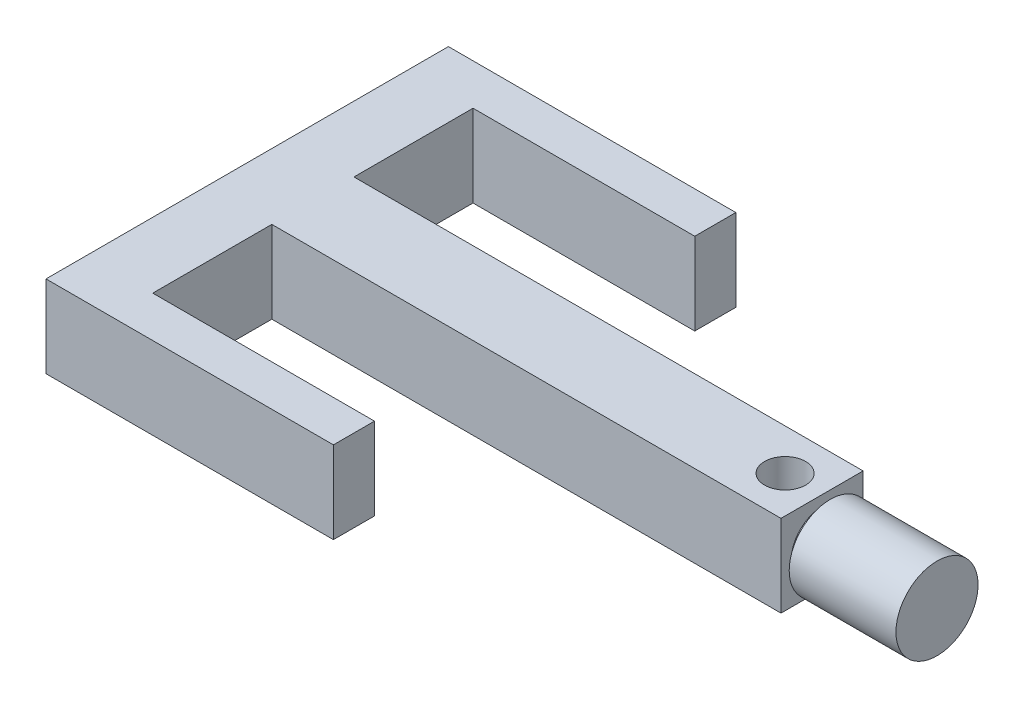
ISO-10303-21;
HEADER;
FILE_DESCRIPTION(('STEP AP214'),'2;1');
FILE_NAME('part.step','',(''),(''),'','','');
FILE_SCHEMA(('AUTOMOTIVE_DESIGN { 1 0 10303 214 1 1 1 1 }'));
ENDSEC;
DATA;
#1=APPLICATION_CONTEXT('core data for automotive mechanical design processes');
#2=APPLICATION_PROTOCOL_DEFINITION('international standard','automotive_design',2000,#1);
#3=PRODUCT_CONTEXT('',#1,'mechanical');
#4=PRODUCT('Part','Part','',(#3));
#5=PRODUCT_RELATED_PRODUCT_CATEGORY('part','',(#4));
#6=PRODUCT_DEFINITION_FORMATION('','',#4);
#7=PRODUCT_DEFINITION_CONTEXT('part definition',#1,'design');
#8=PRODUCT_DEFINITION('design','',#6,#7);
#9=PRODUCT_DEFINITION_SHAPE('','',#8);
#10=(LENGTH_UNIT() NAMED_UNIT(*) SI_UNIT(.MILLI.,.METRE.));
#11=(NAMED_UNIT(*) PLANE_ANGLE_UNIT() SI_UNIT($,.RADIAN.));
#12=(NAMED_UNIT(*) SI_UNIT($,.STERADIAN.) SOLID_ANGLE_UNIT());
#13=UNCERTAINTY_MEASURE_WITH_UNIT(LENGTH_MEASURE(1.E-05),#10,'distance_accuracy_value','');
#14=(GEOMETRIC_REPRESENTATION_CONTEXT(3) GLOBAL_UNCERTAINTY_ASSIGNED_CONTEXT((#13)) GLOBAL_UNIT_ASSIGNED_CONTEXT((#10,
#11,#12)) REPRESENTATION_CONTEXT('',''));
#15=CARTESIAN_POINT('',(0.,0.,0.));
#16=DIRECTION('',(0.,0.,1.));
#17=DIRECTION('',(1.,0.,0.));
#18=AXIS2_PLACEMENT_3D('',#15,#16,#17);
#19=CARTESIAN_POINT('',(70.,20.,0.));
#20=DIRECTION('',(0.,0.,-1.));
#21=DIRECTION('',(-1.,0.,0.));
#22=AXIS2_PLACEMENT_3D('',#19,#20,#21);
#23=PLANE('',#22);
#24=DIRECTION('',(1.,0.,0.));
#25=VECTOR('',#24,1.);
#26=CARTESIAN_POINT('',(70.,0.,0.));
#27=LINE('',#26,#25);
#28=CARTESIAN_POINT('',(0.,0.,0.));
#29=VERTEX_POINT('',#28);
#30=CARTESIAN_POINT('',(70.,0.,0.));
#31=VERTEX_POINT('',#30);
#32=EDGE_CURVE('E167',#29,#31,#27,.T.);
#33=ORIENTED_EDGE('',*,*,#32,.T.);
#34=DIRECTION('',(0.,-1.,0.));
#35=VECTOR('',#34,1.);
#36=CARTESIAN_POINT('',(70.,20.,0.));
#37=LINE('',#36,#35);
#38=CARTESIAN_POINT('',(70.,20.,0.));
#39=VERTEX_POINT('',#38);
#40=EDGE_CURVE('E49',#39,#31,#37,.T.);
#41=ORIENTED_EDGE('',*,*,#40,.F.);
#42=DIRECTION('',(1.,0.,0.));
#43=VECTOR('',#42,1.);
#44=CARTESIAN_POINT('',(70.,20.,0.));
#45=LINE('',#44,#43);
#46=CARTESIAN_POINT('',(0.,20.,0.));
#47=VERTEX_POINT('',#46);
#48=EDGE_CURVE('E202',#47,#39,#45,.T.);
#49=ORIENTED_EDGE('',*,*,#48,.F.);
#50=DIRECTION('',(0.,-1.,0.));
#51=VECTOR('',#50,1.);
#52=CARTESIAN_POINT('',(0.,20.,0.));
#53=LINE('',#52,#51);
#54=EDGE_CURVE('E163',#47,#29,#53,.T.);
#55=ORIENTED_EDGE('',*,*,#54,.T.);
#56=EDGE_LOOP('',(#33,#41,#49,#55));
#57=FACE_BOUND('',#56,.T.);
#58=ADVANCED_FACE('F39',(#57),#23,.F.);
#59=CARTESIAN_POINT('',(70.,20.,-10.));
#60=DIRECTION('',(-1.,0.,0.));
#61=DIRECTION('',(0.,0.,1.));
#62=AXIS2_PLACEMENT_3D('',#59,#60,#61);
#63=PLANE('',#62);
#64=DIRECTION('',(0.,0.,-1.));
#65=VECTOR('',#64,1.);
#66=CARTESIAN_POINT('',(70.,0.,-10.));
#67=LINE('',#66,#65);
#68=CARTESIAN_POINT('',(70.,0.,-10.));
#69=VERTEX_POINT('',#68);
#70=EDGE_CURVE('E171',#31,#69,#67,.T.);
#71=ORIENTED_EDGE('',*,*,#70,.T.);
#72=DIRECTION('',(0.,-1.,0.));
#73=VECTOR('',#72,1.);
#74=CARTESIAN_POINT('',(70.,20.,-10.));
#75=LINE('',#74,#73);
#76=CARTESIAN_POINT('',(70.,20.,-10.));
#77=VERTEX_POINT('',#76);
#78=EDGE_CURVE('E233',#77,#69,#75,.T.);
#79=ORIENTED_EDGE('',*,*,#78,.F.);
#80=DIRECTION('',(0.,0.,-1.));
#81=VECTOR('',#80,1.);
#82=CARTESIAN_POINT('',(70.,20.,-10.));
#83=LINE('',#82,#81);
#84=EDGE_CURVE('E114',#39,#77,#83,.T.);
#85=ORIENTED_EDGE('',*,*,#84,.F.);
#86=ORIENTED_EDGE('',*,*,#40,.T.);
#87=EDGE_LOOP('',(#71,#79,#85,#86));
#88=FACE_BOUND('',#87,.T.);
#89=ADVANCED_FACE('F238',(#88),#63,.F.);
#90=CARTESIAN_POINT('',(16.,20.,-10.));
#91=DIRECTION('',(0.,0.,1.));
#92=DIRECTION('',(1.,0.,0.));
#93=AXIS2_PLACEMENT_3D('',#90,#91,#92);
#94=PLANE('',#93);
#95=DIRECTION('',(-1.,0.,0.));
#96=VECTOR('',#95,1.);
#97=CARTESIAN_POINT('',(16.,0.,-10.));
#98=LINE('',#97,#96);
#99=CARTESIAN_POINT('',(16.,0.,-10.));
#100=VERTEX_POINT('',#99);
#101=EDGE_CURVE('E175',#69,#100,#98,.T.);
#102=ORIENTED_EDGE('',*,*,#101,.T.);
#103=DIRECTION('',(0.,-1.,0.));
#104=VECTOR('',#103,1.);
#105=CARTESIAN_POINT('',(16.,20.,-10.));
#106=LINE('',#105,#104);
#107=CARTESIAN_POINT('',(16.,20.,-10.));
#108=VERTEX_POINT('',#107);
#109=EDGE_CURVE('E229',#108,#100,#106,.T.);
#110=ORIENTED_EDGE('',*,*,#109,.F.);
#111=DIRECTION('',(-1.,0.,0.));
#112=VECTOR('',#111,1.);
#113=CARTESIAN_POINT('',(16.,20.,-10.));
#114=LINE('',#113,#112);
#115=EDGE_CURVE('E259',#77,#108,#114,.T.);
#116=ORIENTED_EDGE('',*,*,#115,.F.);
#117=ORIENTED_EDGE('',*,*,#78,.T.);
#118=EDGE_LOOP('',(#102,#110,#116,#117));
#119=FACE_BOUND('',#118,.T.);
#120=ADVANCED_FACE('F249',(#119),#94,.F.);
#121=CARTESIAN_POINT('',(16.,20.,-39.));
#122=DIRECTION('',(-1.,0.,0.));
#123=DIRECTION('',(0.,0.,1.));
#124=AXIS2_PLACEMENT_3D('',#121,#122,#123);
#125=PLANE('',#124);
#126=DIRECTION('',(0.,0.,-1.));
#127=VECTOR('',#126,1.);
#128=CARTESIAN_POINT('',(16.,0.,-39.));
#129=LINE('',#128,#127);
#130=CARTESIAN_POINT('',(16.,0.,-39.));
#131=VERTEX_POINT('',#130);
#132=EDGE_CURVE('E178',#100,#131,#129,.T.);
#133=ORIENTED_EDGE('',*,*,#132,.T.);
#134=DIRECTION('',(0.,-1.,0.));
#135=VECTOR('',#134,1.);
#136=CARTESIAN_POINT('',(16.,20.,-39.));
#137=LINE('',#136,#135);
#138=CARTESIAN_POINT('',(16.,20.,-39.));
#139=VERTEX_POINT('',#138);
#140=EDGE_CURVE('E225',#139,#131,#137,.T.);
#141=ORIENTED_EDGE('',*,*,#140,.F.);
#142=DIRECTION('',(0.,0.,-1.));
#143=VECTOR('',#142,1.);
#144=CARTESIAN_POINT('',(16.,20.,-39.));
#145=LINE('',#144,#143);
#146=EDGE_CURVE('E255',#108,#139,#145,.T.);
#147=ORIENTED_EDGE('',*,*,#146,.F.);
#148=ORIENTED_EDGE('',*,*,#109,.T.);
#149=EDGE_LOOP('',(#133,#141,#147,#148));
#150=FACE_BOUND('',#149,.T.);
#151=ADVANCED_FACE('F253',(#150),#125,.F.);
#152=CARTESIAN_POINT('',(140.,20.,-39.));
#153=DIRECTION('',(0.,0.,-1.));
#154=DIRECTION('',(-1.,0.,0.));
#155=AXIS2_PLACEMENT_3D('',#152,#153,#154);
#156=PLANE('',#155);
#157=DIRECTION('',(1.,0.,0.));
#158=VECTOR('',#157,1.);
#159=CARTESIAN_POINT('',(140.,0.,-39.));
#160=LINE('',#159,#158);
#161=CARTESIAN_POINT('',(140.,0.,-39.));
#162=VERTEX_POINT('',#161);
#163=EDGE_CURVE('E181',#131,#162,#160,.T.);
#164=ORIENTED_EDGE('',*,*,#163,.T.);
#165=DIRECTION('',(0.,-1.,0.));
#166=VECTOR('',#165,1.);
#167=CARTESIAN_POINT('',(140.,20.,-39.));
#168=LINE('',#167,#166);
#169=CARTESIAN_POINT('',(140.,20.,-39.));
#170=VERTEX_POINT('',#169);
#171=EDGE_CURVE('E221',#170,#162,#168,.T.);
#172=ORIENTED_EDGE('',*,*,#171,.F.);
#173=DIRECTION('',(1.,0.,0.));
#174=VECTOR('',#173,1.);
#175=CARTESIAN_POINT('',(140.,20.,-39.));
#176=LINE('',#175,#174);
#177=EDGE_CURVE('E258',#139,#170,#176,.T.);
#178=ORIENTED_EDGE('',*,*,#177,.F.);
#179=ORIENTED_EDGE('',*,*,#140,.T.);
#180=EDGE_LOOP('',(#164,#172,#178,#179));
#181=FACE_BOUND('',#180,.T.);
#182=ADVANCED_FACE('F296',(#181),#156,.F.);
#183=CARTESIAN_POINT('',(140.,20.,-59.));
#184=DIRECTION('',(-1.,0.,0.));
#185=DIRECTION('',(0.,0.,1.));
#186=AXIS2_PLACEMENT_3D('',#183,#184,#185);
#187=PLANE('',#186);
#188=CARTESIAN_POINT('',(140.,10.,-49.));
#189=DIRECTION('',(1.,0.,0.));
#190=DIRECTION('',(0.,0.,-1.));
#191=AXIS2_PLACEMENT_3D('',#188,#189,#190);
#192=CIRCLE('',#191,7.5);
#193=CARTESIAN_POINT('',(140.,10.,-56.5));
#194=VERTEX_POINT('',#193);
#195=EDGE_CURVE('E11',#194,#194,#192,.T.);
#196=ORIENTED_EDGE('',*,*,#195,.F.);
#197=EDGE_LOOP('',(#196));
#198=FACE_BOUND('',#197,.T.);
#199=DIRECTION('',(0.,0.,-1.));
#200=VECTOR('',#199,1.);
#201=CARTESIAN_POINT('',(140.,0.,-59.));
#202=LINE('',#201,#200);
#203=CARTESIAN_POINT('',(140.,0.,-59.));
#204=VERTEX_POINT('',#203);
#205=EDGE_CURVE('E184',#162,#204,#202,.T.);
#206=ORIENTED_EDGE('',*,*,#205,.T.);
#207=DIRECTION('',(0.,-1.,0.));
#208=VECTOR('',#207,1.);
#209=CARTESIAN_POINT('',(140.,20.,-59.));
#210=LINE('',#209,#208);
#211=CARTESIAN_POINT('',(140.,20.,-59.));
#212=VERTEX_POINT('',#211);
#213=EDGE_CURVE('E217',#212,#204,#210,.T.);
#214=ORIENTED_EDGE('',*,*,#213,.F.);
#215=DIRECTION('',(0.,0.,-1.));
#216=VECTOR('',#215,1.);
#217=CARTESIAN_POINT('',(140.,20.,-59.));
#218=LINE('',#217,#216);
#219=EDGE_CURVE('E263',#170,#212,#218,.T.);
#220=ORIENTED_EDGE('',*,*,#219,.F.);
#221=ORIENTED_EDGE('',*,*,#171,.T.);
#222=EDGE_LOOP('',(#206,#214,#220,#221));
#223=FACE_BOUND('',#222,.T.);
#224=ADVANCED_FACE('F293',(#198,#223),#187,.F.);
#225=CARTESIAN_POINT('',(16.,20.,-59.));
#226=DIRECTION('',(0.,0.,1.));
#227=DIRECTION('',(1.,0.,0.));
#228=AXIS2_PLACEMENT_3D('',#225,#226,#227);
#229=PLANE('',#228);
#230=DIRECTION('',(-1.,0.,0.));
#231=VECTOR('',#230,1.);
#232=CARTESIAN_POINT('',(16.,0.,-59.));
#233=LINE('',#232,#231);
#234=CARTESIAN_POINT('',(16.,0.,-59.));
#235=VERTEX_POINT('',#234);
#236=EDGE_CURVE('E187',#204,#235,#233,.T.);
#237=ORIENTED_EDGE('',*,*,#236,.T.);
#238=DIRECTION('',(0.,-1.,0.));
#239=VECTOR('',#238,1.);
#240=CARTESIAN_POINT('',(16.,20.,-59.));
#241=LINE('',#240,#239);
#242=CARTESIAN_POINT('',(16.,20.,-59.));
#243=VERTEX_POINT('',#242);
#244=EDGE_CURVE('E213',#243,#235,#241,.T.);
#245=ORIENTED_EDGE('',*,*,#244,.F.);
#246=DIRECTION('',(-1.,0.,0.));
#247=VECTOR('',#246,1.);
#248=CARTESIAN_POINT('',(16.,20.,-59.));
#249=LINE('',#248,#247);
#250=EDGE_CURVE('E270',#212,#243,#249,.T.);
#251=ORIENTED_EDGE('',*,*,#250,.F.);
#252=ORIENTED_EDGE('',*,*,#213,.T.);
#253=EDGE_LOOP('',(#237,#245,#251,#252));
#254=FACE_BOUND('',#253,.T.);
#255=ADVANCED_FACE('F289',(#254),#229,.F.);
#256=CARTESIAN_POINT('',(16.,20.,-88.));
#257=DIRECTION('',(-1.,0.,0.));
#258=DIRECTION('',(0.,0.,1.));
#259=AXIS2_PLACEMENT_3D('',#256,#257,#258);
#260=PLANE('',#259);
#261=DIRECTION('',(0.,0.,-1.));
#262=VECTOR('',#261,1.);
#263=CARTESIAN_POINT('',(16.,0.,-88.));
#264=LINE('',#263,#262);
#265=CARTESIAN_POINT('',(16.,0.,-88.));
#266=VERTEX_POINT('',#265);
#267=EDGE_CURVE('E190',#235,#266,#264,.T.);
#268=ORIENTED_EDGE('',*,*,#267,.T.);
#269=DIRECTION('',(0.,-1.,0.));
#270=VECTOR('',#269,1.);
#271=CARTESIAN_POINT('',(16.,20.,-88.));
#272=LINE('',#271,#270);
#273=CARTESIAN_POINT('',(16.,20.,-88.));
#274=VERTEX_POINT('',#273);
#275=EDGE_CURVE('E209',#274,#266,#272,.T.);
#276=ORIENTED_EDGE('',*,*,#275,.F.);
#277=DIRECTION('',(0.,0.,-1.));
#278=VECTOR('',#277,1.);
#279=CARTESIAN_POINT('',(16.,20.,-88.));
#280=LINE('',#279,#278);
#281=EDGE_CURVE('E273',#243,#274,#280,.T.);
#282=ORIENTED_EDGE('',*,*,#281,.F.);
#283=ORIENTED_EDGE('',*,*,#244,.T.);
#284=EDGE_LOOP('',(#268,#276,#282,#283));
#285=FACE_BOUND('',#284,.T.);
#286=ADVANCED_FACE('F281',(#285),#260,.F.);
#287=CARTESIAN_POINT('',(70.,20.,-88.0000000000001));
#288=DIRECTION('',(0.,0.,-1.));
#289=DIRECTION('',(-1.,0.,0.));
#290=AXIS2_PLACEMENT_3D('',#287,#288,#289);
#291=PLANE('',#290);
#292=DIRECTION('',(1.,0.,0.));
#293=VECTOR('',#292,1.);
#294=CARTESIAN_POINT('',(70.,0.,-88.0000000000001));
#295=LINE('',#294,#293);
#296=CARTESIAN_POINT('',(70.,0.,-88.0000000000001));
#297=VERTEX_POINT('',#296);
#298=EDGE_CURVE('E193',#266,#297,#295,.T.);
#299=ORIENTED_EDGE('',*,*,#298,.T.);
#300=DIRECTION('',(0.,-1.,0.));
#301=VECTOR('',#300,1.);
#302=CARTESIAN_POINT('',(70.,20.,-88.0000000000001));
#303=LINE('',#302,#301);
#304=CARTESIAN_POINT('',(70.,20.,-88.0000000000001));
#305=VERTEX_POINT('',#304);
#306=EDGE_CURVE('E156',#305,#297,#303,.T.);
#307=ORIENTED_EDGE('',*,*,#306,.F.);
#308=DIRECTION('',(1.,0.,0.));
#309=VECTOR('',#308,1.);
#310=CARTESIAN_POINT('',(70.,20.,-88.0000000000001));
#311=LINE('',#310,#309);
#312=EDGE_CURVE('E145',#274,#305,#311,.T.);
#313=ORIENTED_EDGE('',*,*,#312,.F.);
#314=ORIENTED_EDGE('',*,*,#275,.T.);
#315=EDGE_LOOP('',(#299,#307,#313,#314));
#316=FACE_BOUND('',#315,.T.);
#317=ADVANCED_FACE('F285',(#316),#291,.F.);
#318=CARTESIAN_POINT('',(70.,20.,-98.));
#319=DIRECTION('',(-1.,0.,0.));
#320=DIRECTION('',(0.,0.,1.));
#321=AXIS2_PLACEMENT_3D('',#318,#319,#320);
#322=PLANE('',#321);
#323=DIRECTION('',(0.,0.,-1.));
#324=VECTOR('',#323,1.);
#325=CARTESIAN_POINT('',(70.,0.,-98.));
#326=LINE('',#325,#324);
#327=CARTESIAN_POINT('',(70.,0.,-98.));
#328=VERTEX_POINT('',#327);
#329=EDGE_CURVE('E154',#297,#328,#326,.T.);
#330=ORIENTED_EDGE('',*,*,#329,.T.);
#331=DIRECTION('',(0.,-1.,0.));
#332=VECTOR('',#331,1.);
#333=CARTESIAN_POINT('',(70.,20.,-98.));
#334=LINE('',#333,#332);
#335=CARTESIAN_POINT('',(70.,20.,-98.));
#336=VERTEX_POINT('',#335);
#337=EDGE_CURVE('E151',#336,#328,#334,.T.);
#338=ORIENTED_EDGE('',*,*,#337,.F.);
#339=DIRECTION('',(0.,0.,-1.));
#340=VECTOR('',#339,1.);
#341=CARTESIAN_POINT('',(70.,20.,-98.));
#342=LINE('',#341,#340);
#343=EDGE_CURVE('E139',#305,#336,#342,.T.);
#344=ORIENTED_EDGE('',*,*,#343,.F.);
#345=ORIENTED_EDGE('',*,*,#306,.T.);
#346=EDGE_LOOP('',(#330,#338,#344,#345));
#347=FACE_BOUND('',#346,.T.);
#348=ADVANCED_FACE('F152',(#347),#322,.F.);
#349=CARTESIAN_POINT('',(0.,20.,-98.));
#350=DIRECTION('',(0.,0.,1.));
#351=DIRECTION('',(1.,0.,0.));
#352=AXIS2_PLACEMENT_3D('',#349,#350,#351);
#353=PLANE('',#352);
#354=DIRECTION('',(-1.,0.,0.));
#355=VECTOR('',#354,1.);
#356=CARTESIAN_POINT('',(0.,0.,-98.));
#357=LINE('',#356,#355);
#358=CARTESIAN_POINT('',(0.,0.,-98.));
#359=VERTEX_POINT('',#358);
#360=EDGE_CURVE('E99',#328,#359,#357,.T.);
#361=ORIENTED_EDGE('',*,*,#360,.T.);
#362=DIRECTION('',(0.,-1.,0.));
#363=VECTOR('',#362,1.);
#364=CARTESIAN_POINT('',(0.,20.,-98.));
#365=LINE('',#364,#363);
#366=CARTESIAN_POINT('',(0.,20.,-98.));
#367=VERTEX_POINT('',#366);
#368=EDGE_CURVE('E157',#367,#359,#365,.T.);
#369=ORIENTED_EDGE('',*,*,#368,.F.);
#370=DIRECTION('',(-1.,0.,0.));
#371=VECTOR('',#370,1.);
#372=CARTESIAN_POINT('',(0.,20.,-98.));
#373=LINE('',#372,#371);
#374=EDGE_CURVE('E143',#336,#367,#373,.T.);
#375=ORIENTED_EDGE('',*,*,#374,.F.);
#376=ORIENTED_EDGE('',*,*,#337,.T.);
#377=EDGE_LOOP('',(#361,#369,#375,#376));
#378=FACE_BOUND('',#377,.T.);
#379=ADVANCED_FACE('F159',(#378),#353,.F.);
#380=CARTESIAN_POINT('',(0.,20.,0.));
#381=DIRECTION('',(1.,0.,0.));
#382=DIRECTION('',(0.,0.,-1.));
#383=AXIS2_PLACEMENT_3D('',#380,#381,#382);
#384=PLANE('',#383);
#385=DIRECTION('',(0.,0.,1.));
#386=VECTOR('',#385,1.);
#387=CARTESIAN_POINT('',(0.,0.,0.));
#388=LINE('',#387,#386);
#389=EDGE_CURVE('E105',#359,#29,#388,.T.);
#390=ORIENTED_EDGE('',*,*,#389,.T.);
#391=ORIENTED_EDGE('',*,*,#54,.F.);
#392=DIRECTION('',(0.,0.,1.));
#393=VECTOR('',#392,1.);
#394=CARTESIAN_POINT('',(0.,20.,0.));
#395=LINE('',#394,#393);
#396=EDGE_CURVE('E58',#367,#47,#395,.T.);
#397=ORIENTED_EDGE('',*,*,#396,.F.);
#398=ORIENTED_EDGE('',*,*,#368,.T.);
#399=EDGE_LOOP('',(#390,#391,#397,#398));
#400=FACE_BOUND('',#399,.T.);
#401=ADVANCED_FACE('F366',(#400),#384,.F.);
#402=CARTESIAN_POINT('',(0.,20.,0.));
#403=DIRECTION('',(0.,-1.,0.));
#404=DIRECTION('',(0.,0.,-1.));
#405=AXIS2_PLACEMENT_3D('',#402,#403,#404);
#406=PLANE('',#405);
#407=CARTESIAN_POINT('',(131.,20.,-49.));
#408=DIRECTION('',(0.,1.,0.));
#409=DIRECTION('',(0.,0.,1.));
#410=AXIS2_PLACEMENT_3D('',#407,#408,#409);
#411=CIRCLE('',#410,4.99999999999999);
#412=CARTESIAN_POINT('',(131.,20.,-44.));
#413=VERTEX_POINT('',#412);
#414=EDGE_CURVE('E456',#413,#413,#411,.T.);
#415=ORIENTED_EDGE('',*,*,#414,.F.);
#416=EDGE_LOOP('',(#415));
#417=FACE_BOUND('',#416,.T.);
#418=ORIENTED_EDGE('',*,*,#48,.T.);
#419=ORIENTED_EDGE('',*,*,#84,.T.);
#420=ORIENTED_EDGE('',*,*,#115,.T.);
#421=ORIENTED_EDGE('',*,*,#146,.T.);
#422=ORIENTED_EDGE('',*,*,#177,.T.);
#423=ORIENTED_EDGE('',*,*,#219,.T.);
#424=ORIENTED_EDGE('',*,*,#250,.T.);
#425=ORIENTED_EDGE('',*,*,#281,.T.);
#426=ORIENTED_EDGE('',*,*,#312,.T.);
#427=ORIENTED_EDGE('',*,*,#343,.T.);
#428=ORIENTED_EDGE('',*,*,#374,.T.);
#429=ORIENTED_EDGE('',*,*,#396,.T.);
#430=EDGE_LOOP('',(#418,#419,#420,#421,#422,#423,#424,#425,#426,#427,#428,#429));
#431=FACE_BOUND('',#430,.T.);
#432=ADVANCED_FACE('F141',(#417,#431),#406,.F.);
#433=CARTESIAN_POINT('',(0.,0.,0.));
#434=DIRECTION('',(0.,-1.,0.));
#435=DIRECTION('',(0.,0.,-1.));
#436=AXIS2_PLACEMENT_3D('',#433,#434,#435);
#437=PLANE('',#436);
#438=CARTESIAN_POINT('',(131.,0.,-49.));
#439=DIRECTION('',(0.,-1.,0.));
#440=DIRECTION('',(0.,0.,-1.));
#441=AXIS2_PLACEMENT_3D('',#438,#439,#440);
#442=CIRCLE('',#441,4.99999999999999);
#443=CARTESIAN_POINT('',(131.,0.,-54.));
#444=VERTEX_POINT('',#443);
#445=EDGE_CURVE('E42',#444,#444,#442,.T.);
#446=ORIENTED_EDGE('',*,*,#445,.F.);
#447=EDGE_LOOP('',(#446));
#448=FACE_BOUND('',#447,.T.);
#449=ORIENTED_EDGE('',*,*,#32,.F.);
#450=ORIENTED_EDGE('',*,*,#389,.F.);
#451=ORIENTED_EDGE('',*,*,#360,.F.);
#452=ORIENTED_EDGE('',*,*,#329,.F.);
#453=ORIENTED_EDGE('',*,*,#298,.F.);
#454=ORIENTED_EDGE('',*,*,#267,.F.);
#455=ORIENTED_EDGE('',*,*,#236,.F.);
#456=ORIENTED_EDGE('',*,*,#205,.F.);
#457=ORIENTED_EDGE('',*,*,#163,.F.);
#458=ORIENTED_EDGE('',*,*,#132,.F.);
#459=ORIENTED_EDGE('',*,*,#101,.F.);
#460=ORIENTED_EDGE('',*,*,#70,.F.);
#461=EDGE_LOOP('',(#449,#450,#451,#452,#453,#454,#455,#456,#457,#458,#459,#460));
#462=FACE_BOUND('',#461,.T.);
#463=ADVANCED_FACE('F243',(#448,#462),#437,.T.);
#464=CARTESIAN_POINT('',(142.,10.,-49.));
#465=DIRECTION('',(-1.,0.,0.));
#466=DIRECTION('',(0.,0.,1.));
#467=AXIS2_PLACEMENT_3D('',#464,#465,#466);
#468=CYLINDRICAL_SURFACE('',#467,7.5);
#469=CARTESIAN_POINT('',(142.,10.,-49.));
#470=DIRECTION('',(1.,0.,0.));
#471=DIRECTION('',(0.,0.,-1.));
#472=AXIS2_PLACEMENT_3D('',#469,#470,#471);
#473=CIRCLE('',#472,7.5);
#474=CARTESIAN_POINT('',(142.,10.,-56.5));
#475=VERTEX_POINT('',#474);
#476=EDGE_CURVE('E172',#475,#475,#473,.T.);
#477=ORIENTED_EDGE('',*,*,#476,.F.);
#478=EDGE_LOOP('',(#477));
#479=FACE_BOUND('',#478,.T.);
#480=ORIENTED_EDGE('',*,*,#195,.T.);
#481=EDGE_LOOP('',(#480));
#482=FACE_BOUND('',#481,.T.);
#483=ADVANCED_FACE('F386',(#479,#482),#468,.T.);
#484=CARTESIAN_POINT('',(168.,10.,-49.));
#485=DIRECTION('',(-1.,0.,0.));
#486=DIRECTION('',(0.,0.,1.));
#487=AXIS2_PLACEMENT_3D('',#484,#485,#486);
#488=CYLINDRICAL_SURFACE('',#487,10.);
#489=CARTESIAN_POINT('',(168.,10.,-49.));
#490=DIRECTION('',(1.,0.,0.));
#491=DIRECTION('',(0.,0.,-1.));
#492=AXIS2_PLACEMENT_3D('',#489,#490,#491);
#493=CIRCLE('',#492,10.);
#494=CARTESIAN_POINT('',(168.,10.,-39.));
#495=VERTEX_POINT('',#494);
#496=EDGE_CURVE('E462',#495,#495,#493,.T.);
#497=CARTESIAN_POINT('',(142.,10.,-49.));
#498=DIRECTION('',(1.,0.,0.));
#499=DIRECTION('',(0.,0.,-1.));
#500=AXIS2_PLACEMENT_3D('',#497,#498,#499);
#501=CIRCLE('',#500,10.);
#502=CARTESIAN_POINT('',(142.,10.,-39.));
#503=VERTEX_POINT('',#502);
#504=EDGE_CURVE('E460',#503,#503,#501,.T.);
#505=CARTESIAN_POINT('',(168.,10.,-39.));
#506=CARTESIAN_POINT('',(167.729166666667,10.,-39.));
#507=CARTESIAN_POINT('',(167.458333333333,10.,-39.));
#508=CARTESIAN_POINT('',(166.916666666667,10.,-39.));
#509=CARTESIAN_POINT('',(166.645833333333,10.,-39.));
#510=CARTESIAN_POINT('',(166.104166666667,10.,-39.));
#511=CARTESIAN_POINT('',(165.833333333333,10.,-39.));
#512=CARTESIAN_POINT('',(165.291666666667,10.,-39.));
#513=CARTESIAN_POINT('',(165.020833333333,10.,-39.));
#514=CARTESIAN_POINT('',(164.479166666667,10.,-39.));
#515=CARTESIAN_POINT('',(164.208333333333,10.,-39.));
#516=CARTESIAN_POINT('',(163.666666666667,10.,-39.));
#517=CARTESIAN_POINT('',(163.395833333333,10.,-39.));
#518=CARTESIAN_POINT('',(162.854166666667,10.,-39.));
#519=CARTESIAN_POINT('',(162.583333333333,10.,-39.));
#520=CARTESIAN_POINT('',(162.041666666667,10.,-39.));
#521=CARTESIAN_POINT('',(161.770833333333,10.,-39.));
#522=CARTESIAN_POINT('',(161.229166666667,10.,-39.));
#523=CARTESIAN_POINT('',(160.958333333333,10.,-39.));
#524=CARTESIAN_POINT('',(160.416666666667,10.,-39.));
#525=CARTESIAN_POINT('',(160.145833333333,10.,-39.));
#526=CARTESIAN_POINT('',(159.604166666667,10.,-39.));
#527=CARTESIAN_POINT('',(159.333333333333,10.,-39.));
#528=CARTESIAN_POINT('',(158.791666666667,10.,-39.));
#529=CARTESIAN_POINT('',(158.520833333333,10.,-39.));
#530=CARTESIAN_POINT('',(157.979166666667,10.,-39.));
#531=CARTESIAN_POINT('',(157.708333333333,10.,-39.));
#532=CARTESIAN_POINT('',(157.166666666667,10.,-39.));
#533=CARTESIAN_POINT('',(156.895833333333,10.,-39.));
#534=CARTESIAN_POINT('',(156.354166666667,10.,-39.));
#535=CARTESIAN_POINT('',(156.083333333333,10.,-39.));
#536=CARTESIAN_POINT('',(155.541666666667,10.,-39.));
#537=CARTESIAN_POINT('',(155.270833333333,10.,-39.));
#538=CARTESIAN_POINT('',(154.729166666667,10.,-39.));
#539=CARTESIAN_POINT('',(154.458333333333,10.,-39.));
#540=CARTESIAN_POINT('',(153.916666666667,10.,-39.));
#541=CARTESIAN_POINT('',(153.645833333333,10.,-39.));
#542=CARTESIAN_POINT('',(153.104166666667,10.,-39.));
#543=CARTESIAN_POINT('',(152.833333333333,10.,-39.));
#544=CARTESIAN_POINT('',(152.291666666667,10.,-39.));
#545=CARTESIAN_POINT('',(152.020833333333,10.,-39.));
#546=CARTESIAN_POINT('',(151.479166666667,10.,-39.));
#547=CARTESIAN_POINT('',(151.208333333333,10.,-39.));
#548=CARTESIAN_POINT('',(150.666666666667,10.,-39.));
#549=CARTESIAN_POINT('',(150.395833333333,10.,-39.));
#550=CARTESIAN_POINT('',(149.854166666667,10.,-39.));
#551=CARTESIAN_POINT('',(149.583333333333,10.,-39.));
#552=CARTESIAN_POINT('',(149.041666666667,10.,-39.));
#553=CARTESIAN_POINT('',(148.770833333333,10.,-39.));
#554=CARTESIAN_POINT('',(148.229166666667,10.,-39.));
#555=CARTESIAN_POINT('',(147.958333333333,10.,-39.));
#556=CARTESIAN_POINT('',(147.416666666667,10.,-39.));
#557=CARTESIAN_POINT('',(147.145833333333,10.,-39.));
#558=CARTESIAN_POINT('',(146.604166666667,10.,-39.));
#559=CARTESIAN_POINT('',(146.333333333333,10.,-39.));
#560=CARTESIAN_POINT('',(145.791666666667,10.,-39.));
#561=CARTESIAN_POINT('',(145.520833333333,10.,-39.));
#562=CARTESIAN_POINT('',(144.979166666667,10.,-39.));
#563=CARTESIAN_POINT('',(144.708333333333,10.,-39.));
#564=CARTESIAN_POINT('',(144.166666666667,10.,-39.));
#565=CARTESIAN_POINT('',(143.895833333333,10.,-39.));
#566=CARTESIAN_POINT('',(143.354166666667,10.,-39.));
#567=CARTESIAN_POINT('',(143.083333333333,10.,-39.));
#568=CARTESIAN_POINT('',(142.541666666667,10.,-39.));
#569=CARTESIAN_POINT('',(142.270833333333,10.,-39.));
#570=CARTESIAN_POINT('',(142.,10.,-39.));
#571=B_SPLINE_CURVE_WITH_KNOTS('',3,(#505,#506,#507,#508,#509,#510,#511,#512,#513,#514,#515,
#516,#517,#518,#519,#520,#521,#522,#523,#524,#525,#526,#527,#528,#529,#530,#531,#532,#533,#534,
#535,#536,#537,#538,#539,#540,#541,#542,#543,#544,#545,#546,#547,#548,#549,#550,#551,#552,#553,
#554,#555,#556,#557,#558,#559,#560,#561,#562,#563,#564,#565,#566,#567,#568,#569,#570),
.UNSPECIFIED.,.F.,.F.,(4,2,2,2,2,2,2,2,2,2,2,2,2,2,2,2,2,2,2,2,2,2,2,2,2,2,2,2,2,2,2,2,4),(0.,
0.812499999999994,1.62499999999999,2.43749999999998,3.24999999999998,4.0625,4.87499999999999,
5.68749999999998,6.49999999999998,7.3125,8.12499999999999,8.93749999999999,9.74999999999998,
10.5625,11.375,12.1875,13.,13.8125,14.625,15.4375,16.25,17.0625,17.875,18.6875,19.5,20.3125,
21.125,21.9375,22.75,23.5625,24.375,25.1875,26.),.UNSPECIFIED.);
#572=EDGE_CURVE('BSEAM391',#495,#503,#571,.T.);
#573=ORIENTED_EDGE('',*,*,#496,.F.);
#574=ORIENTED_EDGE('',*,*,#504,.T.);
#575=ORIENTED_EDGE('',*,*,#572,.T.);
#576=ORIENTED_EDGE('',*,*,#572,.F.);
#577=EDGE_LOOP('',(#573,#575,#574,#576));
#578=FACE_BOUND('',#577,.T.);
#579=ADVANCED_FACE('F391',(#578),#488,.T.);
#580=CARTESIAN_POINT('',(168.,10.,-49.));
#581=DIRECTION('',(1.,0.,0.));
#582=DIRECTION('',(0.,0.,-1.));
#583=AXIS2_PLACEMENT_3D('',#580,#581,#582);
#584=PLANE('',#583);
#585=ORIENTED_EDGE('',*,*,#496,.T.);
#586=EDGE_LOOP('',(#585));
#587=FACE_BOUND('',#586,.T.);
#588=ADVANCED_FACE('F403',(#587),#584,.T.);
#589=CARTESIAN_POINT('',(142.,10.,-49.));
#590=DIRECTION('',(1.,0.,0.));
#591=DIRECTION('',(0.,0.,-1.));
#592=AXIS2_PLACEMENT_3D('',#589,#590,#591);
#593=PLANE('',#592);
#594=ORIENTED_EDGE('',*,*,#476,.T.);
#595=EDGE_LOOP('',(#594));
#596=FACE_BOUND('',#595,.T.);
#597=ORIENTED_EDGE('',*,*,#504,.F.);
#598=EDGE_LOOP('',(#597));
#599=FACE_BOUND('',#598,.T.);
#600=ADVANCED_FACE('F413',(#596,#599),#593,.F.);
#601=CARTESIAN_POINT('',(131.,-3.00000000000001,-49.));
#602=DIRECTION('',(0.,1.,0.));
#603=DIRECTION('',(0.,0.,1.));
#604=AXIS2_PLACEMENT_3D('',#601,#602,#603);
#605=CYLINDRICAL_SURFACE('',#604,4.99999999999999);
#606=ORIENTED_EDGE('',*,*,#445,.T.);
#607=EDGE_LOOP('',(#606));
#608=FACE_BOUND('',#607,.T.);
#609=ORIENTED_EDGE('',*,*,#414,.T.);
#610=EDGE_LOOP('',(#609));
#611=FACE_BOUND('',#610,.T.);
#612=ADVANCED_FACE('F423',(#608,#611),#605,.F.);
#613=CLOSED_SHELL('',(#58,#89,#120,#151,#182,#224,#255,#286,#317,#348,#379,#401,#432,#463,#483,
#579,#588,#600,#612));
#614=MANIFOLD_SOLID_BREP('B2',#613);
#615=ADVANCED_BREP_SHAPE_REPRESENTATION('',(#18,#614),#14);
#616=SHAPE_DEFINITION_REPRESENTATION(#9,#615);
ENDSEC;
END-ISO-10303-21;
